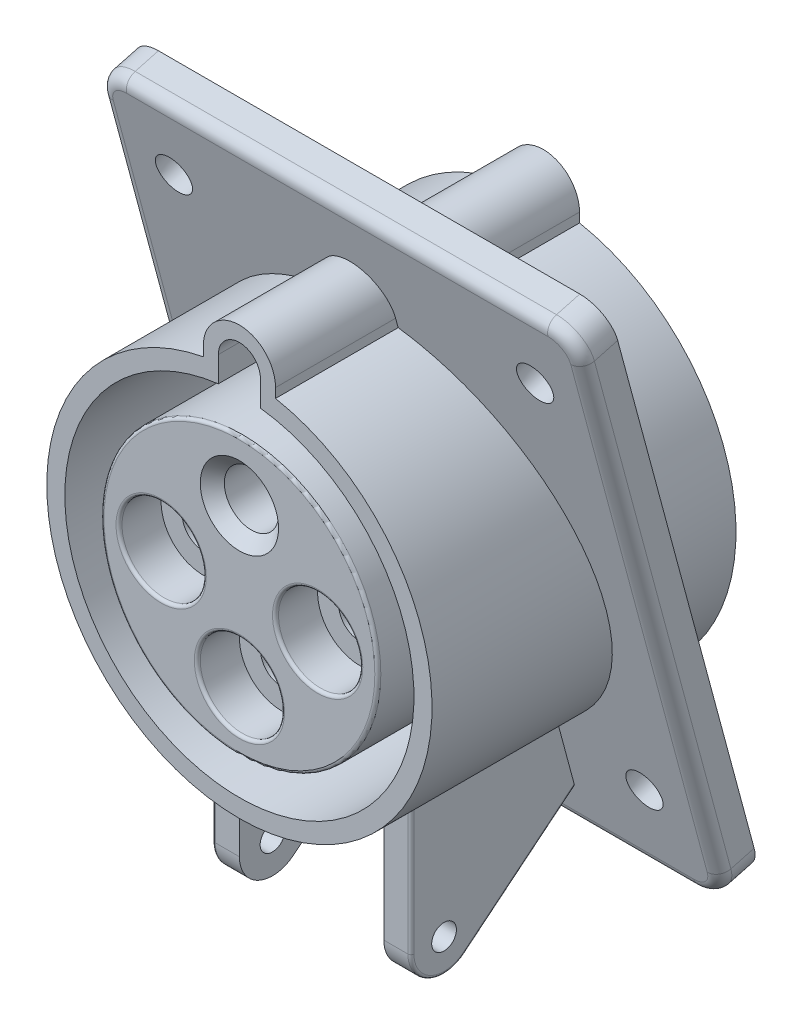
from build123d import *

# Parameters (mm, degrees)
SKETCH_1_R                    = 32
EXTRUDE_1_DEPTH               = 52
SKETCH_2_R                    = 29
CUT_EXTRUDE_1_DEPTH           = 46
SKETCH_3_R                    = 24
CUT_EXTRUDE_2_DEPTH           = 46
SKETCH_4_R                    = 48.798285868
SKETCH_4_R_2                  = 26
CUT_EXTRUDE_3_DEPTH           = 1.5
EXTRUDE_2_DEPTH               = 50.5
CUT_EXTRUDE_4_DEPTH           = 46
EXTRUDE_3_DEPTH               = 40
EXTRUDE_3_DEPTH_BACK          = 40
FILLET_1_R                    = 5
CUT_EXTRUDE_5_DEPTH           = 45
FILLET_2_R                    = 2
SKETCH_9_R                    = 3
CUT_EXTRUDE_6_DEPTH           = 40
CUT_EXTRUDE_6_DRAFT           = 4
CUT_EXTRUDE_6_PROFILE_2_DEPTH = 40
CUT_EXTRUDE_6_PROFILE_2_DRAFT = 4
CUT_EXTRUDE_6_PROFILE_3_DEPTH = 40
CUT_EXTRUDE_6_PROFILE_3_DRAFT = 4
CUT_EXTRUDE_6_PROFILE_4_DEPTH = 40
CUT_EXTRUDE_6_PROFILE_4_DRAFT = 4
SKETCH_10_R                   = 23
EXTRUDE_4_DEPTH               = 50.5
SKETCH_11_R                   = 4.5
SKETCH_11_R_2                 = 3.5
CUT_EXTRUDE_7_DEPTH           = 47
SKETCH_12_R                   = 7
CUT_EXTRUDE_8_DEPTH           = 7
FILLET_3_R                    = 0.5
CHAMFER_1_SIZE                = 2
FILLET_4_R                    = 0.5
EXTRUDE_5_DEPTH               = 16.5
EXTRUDE_5_DEPTH_BACK          = 16.5
SKETCH_13_R                   = 2.054740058
CUT_EXTRUDE_9_DEPTH           = 46
CUT_EXTRUDE_START             = -19.5
CUT_EXTRUDE_10_DEPTH          = 19.5
FILLET_5_R                    = 0.5


with BuildPart() as part:
    # Sketch 1 → Extrude 1 (new body)
    with BuildSketch(Plane.XY):
        with Locations(Location((0, 0, 0), (0, 0, 180))):
            Circle(SKETCH_1_R)
    extrude(amount=EXTRUDE_1_DEPTH)

    # Sketch 2 → Cut-Extrude 1 (cut)
    with BuildSketch(Plane.XY.offset(52)):
        Circle(SKETCH_2_R)
    extrude(amount=-CUT_EXTRUDE_1_DEPTH, mode=Mode.SUBTRACT)

    # Sketch 3 → Cut-Extrude 2 (cut)
    with BuildSketch(Plane(origin=(0, 0, 0), x_dir=(-1, 0, 0), z_dir=(0, 0, -1))):
        Circle(SKETCH_3_R)
    extrude(amount=-CUT_EXTRUDE_2_DEPTH, mode=Mode.SUBTRACT)

    # Sketch 4 → Cut-Extrude 3 (cut)
    with BuildSketch(Plane(origin=(0, 0, 0), x_dir=(-1, 0, 0), z_dir=(0, 0, -1))):
        Circle(SKETCH_4_R)
        Circle(SKETCH_4_R_2, mode=Mode.SUBTRACT)
    extrude(amount=-CUT_EXTRUDE_3_DEPTH, mode=Mode.SUBTRACT)

    # Sketch 5 → Extrude 2 (add)
    with BuildSketch(Plane.XY.offset(52)):
        with BuildLine():
            Line((-6, 33), (-6, 30.53871521))
            Line((-6, 30.53871521), (6, 30.53871521))
            Line((6, 30.53871521), (6, 33))
            ThreePointArc((6, 33), (0, 39), (-6, 33))
        make_face()
    extrude(amount=-EXTRUDE_2_DEPTH)

    # Sketch 6 → Cut-Extrude 4 (cut)
    with BuildSketch(Plane.XY.offset(52)):
        with BuildLine():
            Line((-3.496275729, 33), (-3.496275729, 27.122398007))
            Line((-3.496275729, 27.122398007), (3.496275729, 27.122398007))
            Line((3.496275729, 27.122398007), (3.496275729, 33))
            ThreePointArc((3.496275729, 33), (0, 36.496275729), (-3.496275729, 33))
        make_face()
    extrude(amount=-CUT_EXTRUDE_4_DEPTH, mode=Mode.SUBTRACT)

    # Sketch 7 → Extrude 3 (add, two sides: drawn at the far end of the back side and taken through both)
    with BuildSketch(Plane(origin=(0, 0, 0), x_dir=(0, 0, -1), z_dir=(1, 0, 0)).offset(-EXTRUDE_3_DEPTH_BACK)):
        Polygon((-36.246745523, 48.628291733), (-30.45214322, 50.184757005), (-5.191197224, -43.859831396), (-10.985799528, -45.416296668), align=None)
    extrude(amount=EXTRUDE_3_DEPTH + EXTRUDE_3_DEPTH_BACK)

    # Fillet 1
    fillet_1_edges = [part.edges().sort_by_distance(p)[0] for p in [
        (-40, -44.638064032, 8.088498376),
        (-40, 49.406524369, 33.349444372),
        (40, 49.406524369, 33.349444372),
        (40, -44.638064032, 8.088498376),
    ]]
    fillet(fillet_1_edges, radius=FILLET_1_R)

    # Sketch 8 → Cut-Extrude 5 (cut)
    with BuildSketch(Plane.XY.offset(52)):
        with BuildLine():
            Line((-3.496275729, 33), (-3.496275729, 28.788470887))
            ThreePointArc((-3.496275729, 28.788470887), (0, -29), (3.496275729, 28.788470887))
            Line((3.496275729, 28.788470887), (3.496275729, 33))
            ThreePointArc((3.496275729, 33), (0, 36.496275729), (-3.496275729, 33))
        make_face()
    extrude(amount=-CUT_EXTRUDE_5_DEPTH, mode=Mode.SUBTRACT)

    # Fillet 2
    fillet_2_edges = [part.edges().sort_by_distance(p)[0] for p in [
        (0, -45.416296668, 10.985799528),
        (0, 48.628291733, 36.246745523),
        (-40, 1.605997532, 23.616272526),
        (-38.535533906, -44.001963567, 11.365697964),
        (-38.535533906, 47.213958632, 35.866847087),
        (38.535533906, 47.213958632, 35.866847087),
        (38.535533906, -44.001963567, 11.365697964),
        (40, 1.605997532, 23.616272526),
    ]]
    fillet(fillet_2_edges, radius=FILLET_2_R)


with BuildPart() as cut_extrude_6_tool:
    # Sketch 9 → Cut-Extrude 6 (with draft: the straight prism first)
    with BuildSketch(Plane(origin=(0, -5.808522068, 21.624687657), x_dir=(1, 0, 0), z_dir=(0, -0.25941087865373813, 0.9657670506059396))):
        with Locations((30, 43.351165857)):
            Circle(SKETCH_9_R)
    extrude(amount=-CUT_EXTRUDE_6_DEPTH)
    # Cut-Extrude 6: the draft: its side faces are tilted about the plane it starts from
    cut_extrude_6_sides = [cut_extrude_6_tool.faces().sort_by_distance(p)[0] for p in [
        (27, 41.246823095, 13.555110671),
    ]]
    draft(cut_extrude_6_sides, Plane(origin=(0, -5.808522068, 21.624687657), x_dir=(1, 0, 0), z_dir=(0, -0.25941087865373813, 0.9657670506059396)), CUT_EXTRUDE_6_DRAFT)


with BuildPart() as part_1:
    add(part.part)

    # Cut-Extrude 6: cut by cut_extrude_6_tool
    add(cut_extrude_6_tool.part, mode=Mode.SUBTRACT)


with BuildPart() as cut_extrude_6_profile_2_tool:
    # Sketch 9 → Cut-Extrude 6 profile 2 (with draft: the straight prism first)
    with BuildSketch(Plane(origin=(0, -5.808522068, 21.624687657), x_dir=(1, 0, 0), z_dir=(0, -0.25941087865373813, 0.9657670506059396))):
        with Locations((-30, 43.351165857)):
            Circle(SKETCH_9_R)
    extrude(amount=-CUT_EXTRUDE_6_PROFILE_2_DEPTH)
    # Cut-Extrude 6 profile 2: the draft: its side faces are tilted about the plane it starts from
    cut_extrude_6_profile_2_sides = [cut_extrude_6_profile_2_tool.faces().sort_by_distance(p)[0] for p in [
        (-33, 41.246823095, 13.555110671),
    ]]
    draft(cut_extrude_6_profile_2_sides, Plane(origin=(0, -5.808522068, 21.624687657), x_dir=(1, 0, 0), z_dir=(0, -0.25941087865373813, 0.9657670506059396)), CUT_EXTRUDE_6_PROFILE_2_DRAFT)


with BuildPart() as part_2:
    add(part_1.part)

    # Cut-Extrude 6 profile 2: cut by cut_extrude_6_profile_2_tool
    add(cut_extrude_6_profile_2_tool.part, mode=Mode.SUBTRACT)


with BuildPart() as cut_extrude_6_profile_3_tool:
    # Sketch 9 → Cut-Extrude 6 profile 3 (with draft: the straight prism first)
    with BuildSketch(Plane(origin=(0, -5.808522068, 21.624687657), x_dir=(1, 0, 0), z_dir=(0, -0.25941087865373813, 0.9657670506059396))):
        with Locations((-30, -26.648834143)):
            Circle(SKETCH_9_R)
    extrude(amount=-CUT_EXTRUDE_6_PROFILE_3_DEPTH)
    # Cut-Extrude 6 profile 3: the draft: its side faces are tilted about the plane it starts from
    cut_extrude_6_profile_3_sides = [cut_extrude_6_profile_3_tool.faces().sort_by_distance(p)[0] for p in [
        (-33, -26.356870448, -4.603650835),
    ]]
    draft(cut_extrude_6_profile_3_sides, Plane(origin=(0, -5.808522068, 21.624687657), x_dir=(1, 0, 0), z_dir=(0, -0.25941087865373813, 0.9657670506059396)), CUT_EXTRUDE_6_PROFILE_3_DRAFT)


with BuildPart() as part_3:
    add(part_2.part)

    # Cut-Extrude 6 profile 3: cut by cut_extrude_6_profile_3_tool
    add(cut_extrude_6_profile_3_tool.part, mode=Mode.SUBTRACT)


with BuildPart() as cut_extrude_6_profile_4_tool:
    # Sketch 9 → Cut-Extrude 6 profile 4 (with draft: the straight prism first)
    with BuildSketch(Plane(origin=(0, -5.808522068, 21.624687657), x_dir=(1, 0, 0), z_dir=(0, -0.25941087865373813, 0.9657670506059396))):
        with Locations((30, -26.648834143)):
            Circle(SKETCH_9_R)
    extrude(amount=-CUT_EXTRUDE_6_PROFILE_4_DEPTH)
    # Cut-Extrude 6 profile 4: the draft: its side faces are tilted about the plane it starts from
    cut_extrude_6_profile_4_sides = [cut_extrude_6_profile_4_tool.faces().sort_by_distance(p)[0] for p in [
        (27, -26.356870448, -4.603650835),
    ]]
    draft(cut_extrude_6_profile_4_sides, Plane(origin=(0, -5.808522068, 21.624687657), x_dir=(1, 0, 0), z_dir=(0, -0.25941087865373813, 0.9657670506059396)), CUT_EXTRUDE_6_PROFILE_4_DRAFT)


with BuildPart() as part_4:
    add(part_3.part)

    # Cut-Extrude 6 profile 4: cut by cut_extrude_6_profile_4_tool
    add(cut_extrude_6_profile_4_tool.part, mode=Mode.SUBTRACT)

    # Sketch 13 → Extrude 5 (add, two sides: drawn at the far end of the back side and taken through both)
    with BuildSketch(Plane(origin=(0, 0, 0), x_dir=(0, 0, -1), z_dir=(1, 0, 0)).offset(-EXTRUDE_5_DEPTH_BACK)):
        with BuildLine():
            Line((-40.000032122, -49.5), (-40.000032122, -25.24328513))
            Line((-40.000032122, -25.24328513), (-16.404392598, -25.24328513))
            Line((-16.404392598, -25.24328513), (-12.744813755, -38.867619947))
            Line((-12.744813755, -38.867619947), (-31.025694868, -53.763749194))
            ThreePointArc((-31.025694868, -53.763749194), (-36.860250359, -54.467853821), (-40.000032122, -49.5))
        make_face()
        with Locations((-34.5, -49.5)):
            Circle(SKETCH_13_R, mode=Mode.SUBTRACT)
    extrude(amount=EXTRUDE_5_DEPTH + EXTRUDE_5_DEPTH_BACK)

    # Sketch 14 → Cut-Extrude 9 (cut)
    with BuildSketch(Plane.XY.offset(52)):
        with BuildLine():
            Line((-15.463893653, -24.532998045), (15.792610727, -24.322694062))
            ThreePointArc((15.792610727, -24.322694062), (0.195117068, -28.999343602), (-15.463893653, -24.532998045))
        make_face()
    extrude(amount=-CUT_EXTRUDE_9_DEPTH, mode=Mode.SUBTRACT)

    # Sketch 15 → Cut-Extrude 10 (cut)
    with BuildSketch(Plane.XY.offset(40.000032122).offset(CUT_EXTRUDE_START)):
        with BuildLine():
            Line((-12, -60.389019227), (12, -60.389019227))
            Line((12, -60.389019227), (12, -29.664793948))
            ThreePointArc((12, -29.664793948), (0, -32), (-12, -29.664793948))
            Line((-12, -29.664793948), (-12, -60.389019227))
        make_face()
    extrude(amount=CUT_EXTRUDE_10_DEPTH, mode=Mode.SUBTRACT)

    # Fillet 5
    fillet_5_edges = [part_4.edges().sort_by_distance(p)[0] for p in [
        (16.5, -38.459029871, 40.000032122),
        (16.5, -54.467853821, 36.860250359),
        (16.5, -46.315684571, 21.885254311),
        (-16.5, -38.459029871, 40.000032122),
        (-16.5, -54.467853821, 36.860250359),
        (-16.5, -46.315684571, 21.885254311),
    ]]
    fillet(fillet_5_edges, radius=FILLET_5_R)


with BuildPart() as body_2:
    # Sketch 10 → Extrude 4 (new body)
    with BuildSketch(Plane(origin=(0, 0, 1.5), x_dir=(-1, 0, 0), z_dir=(0, 0, -1))):
        Circle(SKETCH_10_R)
    extrude(amount=-EXTRUDE_4_DEPTH)

    # Sketch 11 → Cut-Extrude 7 (cut)
    with BuildSketch(Plane.XY.offset(52)):
        with Locations((0, 13)):
            Circle(SKETCH_11_R)
        with Locations((13, 0)):
            Circle(SKETCH_11_R_2)
        with Locations((-13, 0)):
            Circle(SKETCH_11_R_2)
        with Locations((0, -13)):
            Circle(SKETCH_11_R_2)
    extrude(amount=-CUT_EXTRUDE_7_DEPTH, mode=Mode.SUBTRACT)

    # Sketch 12 → Cut-Extrude 8 (cut)
    with BuildSketch(Plane.XY.offset(52)):
        with Locations((0, -13)):
            Circle(SKETCH_12_R)
        with Locations((-13, 0)):
            Circle(SKETCH_12_R)
        with Locations((13, 0)):
            Circle(SKETCH_12_R)
    extrude(amount=-CUT_EXTRUDE_8_DEPTH, mode=Mode.SUBTRACT)

    # Fillet 3
    fillet_3_edges = [body_2.edges().sort_by_distance(p)[0] for p in [
        (6, 0, 52),
        (-20, 0, 52),
        (-7, -13, 52),
    ]]
    fillet(fillet_3_edges, radius=FILLET_3_R)

    # Chamfer 1
    chamfer_1_edges = [body_2.edges().sort_by_distance(p)[0] for p in [
        (-4.5, 13, 52),
    ]]
    chamfer(chamfer_1_edges, length=CHAMFER_1_SIZE)

    # Fillet 4
    fillet_4_edges = [body_2.edges().sort_by_distance(p)[0] for p in [
        (23, 0, 52),
    ]]
    fillet(fillet_4_edges, radius=FILLET_4_R)


solid = Compound([part_4.part, body_2.part])
